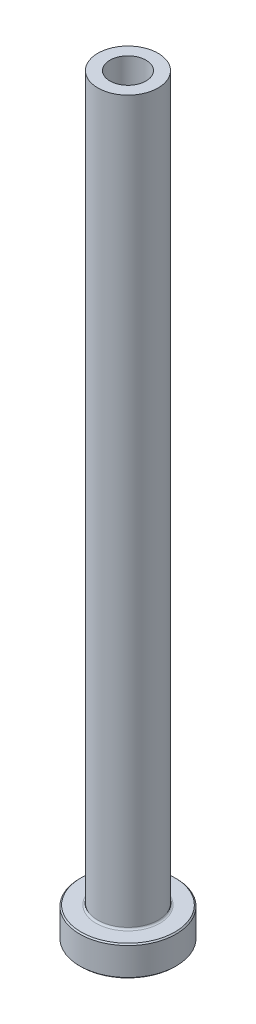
from build123d import *

# Parameters (mm, degrees)
FILLET1_R     = 0.3
CHAMFER1_SIZE = 0.2
CHAMFER3_SIZE = 0.5


with BuildPart() as part:
    # Sketch1 → Revolve1 (revolve)
    with BuildSketch(Plane.XY, mode=Mode.PRIVATE) as revolve1_sk:
        Polygon((-3, 125), (-5, 125), (-5, 5), (-8, 5), (-8, 0), (-3.25, 0), (-3.25, 68), (-3, 80), align=None)
    revolve(revolve1_sk.sketch.rotate(Axis((0, 92.187680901, 0), (0, -1, 0)), 270), axis=Axis((0, 92.187680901, 0), (0, -1, 0)))

    # Fillet1
    fillet1_edges = [part.edges().sort_by_distance(p)[0] for p in [
        (0, 5, -5),
    ]]
    fillet(fillet1_edges, radius=FILLET1_R)

    # Chamfer1
    chamfer1_edges = [part.edges().sort_by_distance(p)[0] for p in [
        (0, 0, -8),
        (0, 5, -8),
    ]]
    chamfer(chamfer1_edges, length=CHAMFER1_SIZE)

    # Chamfer3
    chamfer3_edges = [part.edges().sort_by_distance(p)[0] for p in [
        (0, 0, -3.25),
    ]]
    chamfer(chamfer3_edges, length=CHAMFER3_SIZE)


solid = part.part
